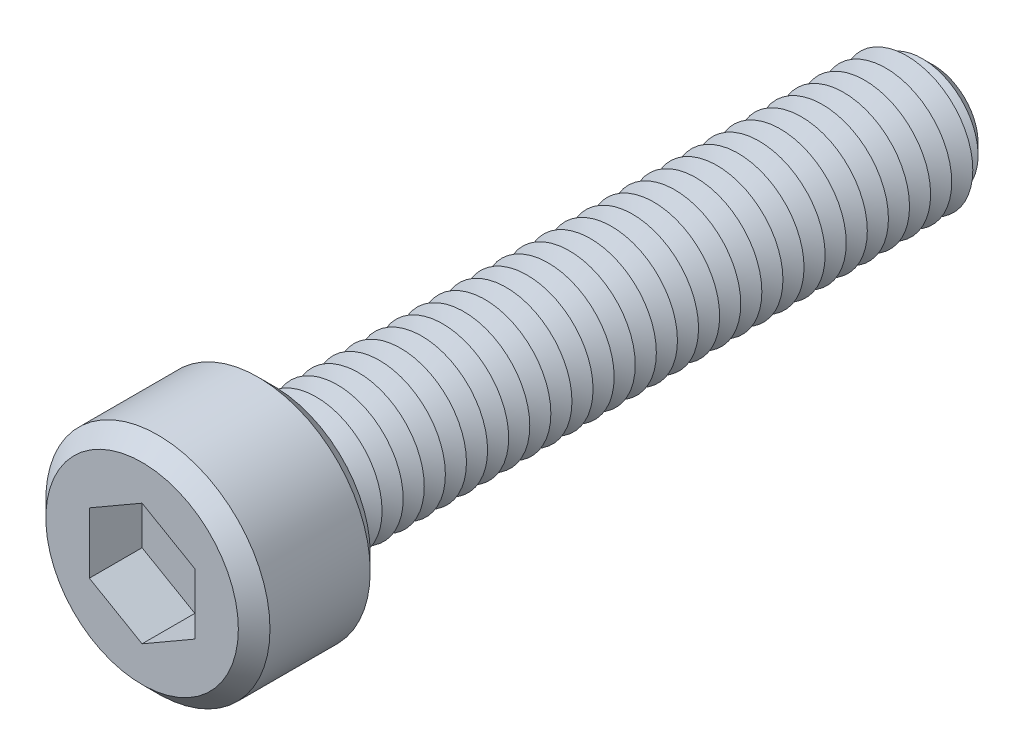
from build123d import *

# Parameters (mm, degrees)
SKETCH1_R           = 4.25
BOSS_EXTRUDE1_DEPTH = 5
SKETCH2_R           = 2.5
BOSS_EXTRUDE2_DEPTH = 25
CHAMFER1_SIZE       = 0.8
LPATTERN1_COUNT     = 31
LPATTERN1_PITCH     = 0.8
CUT_EXTRUDE1_DEPTH  = 2
SKETCH6_R           = 0.65
CUT_EXTRUDE2_DEPTH  = 28
CHAMFER2_SIZE       = 0.6


with BuildPart() as part:
    # Sketch1 → Boss-Extrude1 (new body)
    with BuildSketch(Plane.XY):
        Circle(SKETCH1_R)
    extrude(amount=BOSS_EXTRUDE1_DEPTH)

    # Sketch2 → Boss-Extrude2 (add)
    with BuildSketch(Plane(origin=(0, 0, 0), x_dir=(-1, 0, 0), z_dir=(0, 0, -1))):
        Circle(SKETCH2_R)
    extrude(amount=BOSS_EXTRUDE2_DEPTH)

    # Chamfer1
    chamfer1_edges = [part.edges().sort_by_distance(p)[0] for p in [
        (2.5, 0, -25),
    ]]
    chamfer(chamfer1_edges, length=CHAMFER1_SIZE)

    # Sketch4 → Cut-Revolve1 (revolve, cut)
    with BuildSketch(Plane(origin=(0, 0, 0), x_dir=(0, 0, -1), z_dir=(1, 0, 0)), mode=Mode.PRIVATE) as cut_revolve1_sk:
        Polygon((0, 2.5), (0.4, 1.807179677), (0.8, 2.5), align=None)
    cut_revolve1 = revolve(cut_revolve1_sk.sketch.rotate(Axis((0, 0, 2.512122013), (0, 0, -1)), 90), axis=Axis((0, 0, 2.512122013), (0, 0, -1)), mode=Mode.SUBTRACT)

    # LPattern1: Cut-Revolve1 ×31
    with Locations(*[(0, 0, -i * LPATTERN1_PITCH) for i in range(1, LPATTERN1_COUNT)]):
        add(cut_revolve1, mode=Mode.SUBTRACT)

    # Sketch5 → Cut-Extrude1 (cut)
    with BuildSketch(Plane.XY.offset(5)):
        Polygon((0, 2.309401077), (-2, 1.154700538), (-2, -1.154700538), (0, -2.309401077), (2, -1.154700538), (2, 1.154700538), align=None)
    extrude(amount=-CUT_EXTRUDE1_DEPTH, mode=Mode.SUBTRACT)

    # Sketch6 → Cut-Extrude2 (cut)
    with BuildSketch(Plane.XY.offset(3)):
        Circle(SKETCH6_R)
    extrude(amount=-CUT_EXTRUDE2_DEPTH, mode=Mode.SUBTRACT)

    # Chamfer2
    chamfer2_edges = [part.edges().sort_by_distance(p)[0] for p in [
        (-4.25, 0, 0),
        (-4.25, 0, 5),
    ]]
    chamfer(chamfer2_edges, length=CHAMFER2_SIZE)


solid = part.part
